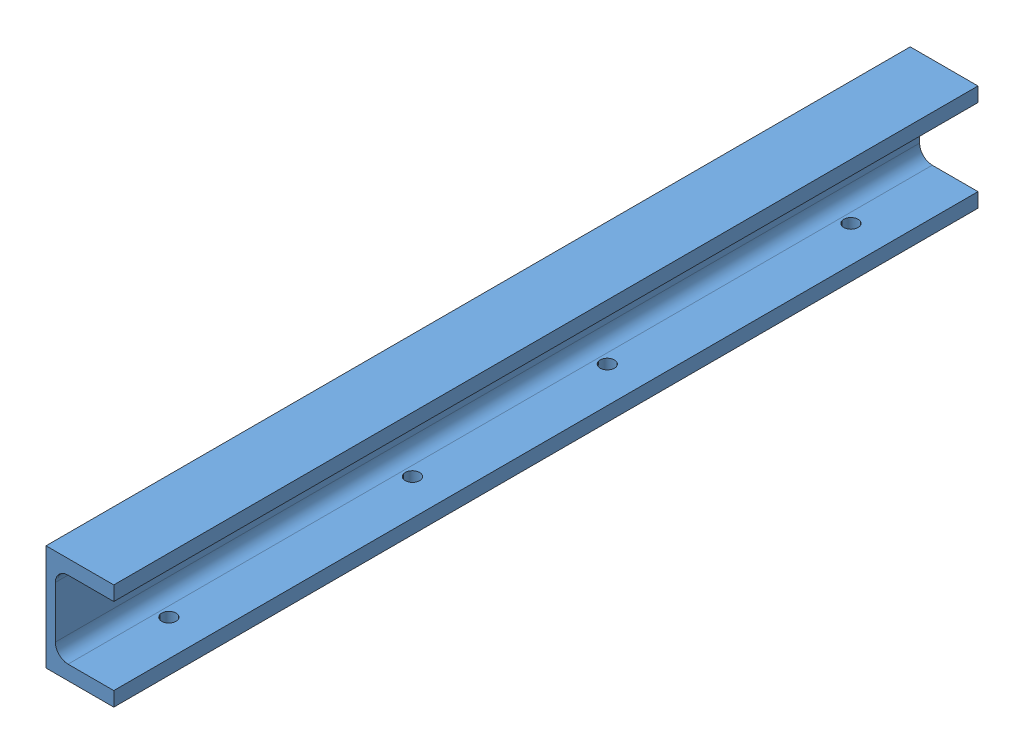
SolidWorks assembly Beam.SLDASM, configuration Initial (file format 14000). Lengths in mm.
Overall size (32 50 408).
3 component instances, 2 part files, 6 mates.
Components (placement in the parent):
- 3930-10452-4-01-1: 3930-10452-4-01.SLDPRT [Výchozí] at origin
- 3930-10104-4-01-1: 3930-10104-4-01.SLDPRT [Výchozí] at (2.5 0 199) (suppressed, hidden)
- 3930-10104-4-01-2: 3930-10104-4-01.SLDPRT [Výchozí] at (2.5 0 -204) (suppressed, hidden)
Mates (geometry in assembly coordinates):
- Sjednocený1: coincident aligned: plane of 3930-10452-4-01-1 through (-5.6 12.2 204) normal (0 0 1); plane of 3930-10104-4-01-1 through (-11 -18 204) normal (0 0 1)
- Sjednocený2: coincident aligned: plane of 3930-10452-4-01-1 through (16 25 204) normal (1 0 0); plane of 3930-10104-4-01-1 through (16 18 204) normal (1 0 0)
- Sjednocený3: coincident: plane of 3930-10104-4-01-1; plane of assembly through (0 0 0) normal (0 1 0)
- Sjednocený4: coincident aligned: plane of 3930-10452-4-01-1 through (-5.6 12.2 -204) normal (0 0 -1); plane of 3930-10104-4-01-2 through (-11 -18 -204) normal (0 0 -1)
- Sjednocený5: coincident aligned: plane of 3930-10452-4-01-1 through (16 25 204) normal (1 0 0); plane of assembly through (16 18 -199) normal (1 0 0)
- Soustředný1: concentric: cylinder of 3930-10104-4-01-1 through (6 0 204) axis (0 0 1) radius 4; cylinder of 3930-10104-4-01-2 through (6 0 -199) axis (0 0 1) radius 4
